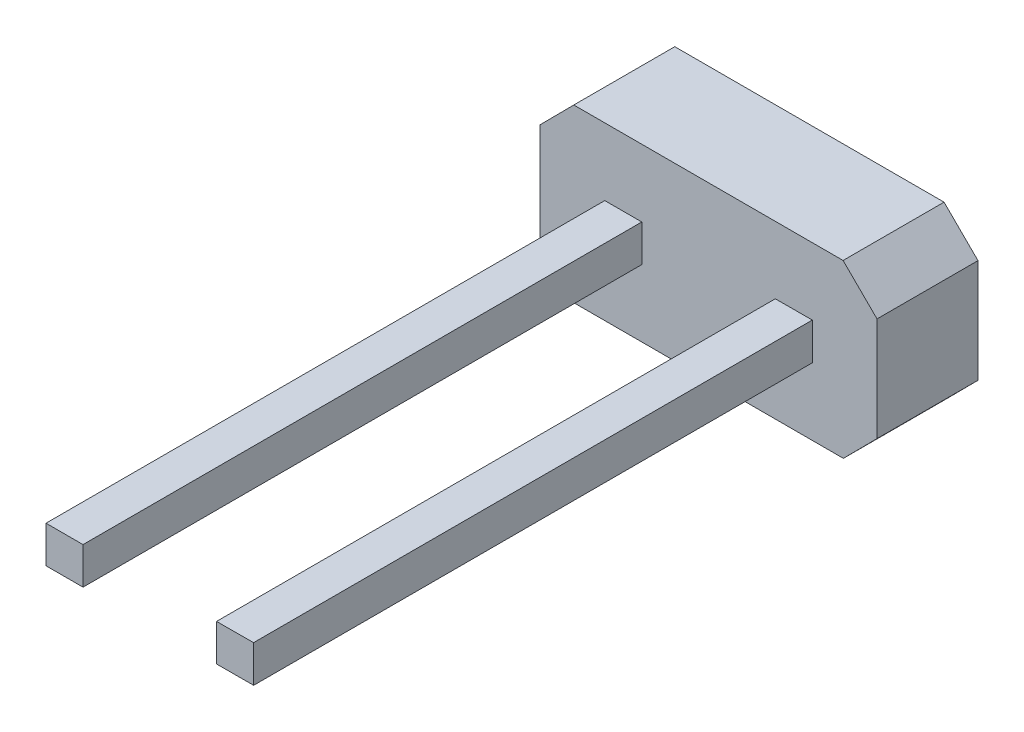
from build123d import *

# Parameters (mm, degrees)
BOSS_EXTRUDE1_DEPTH = 1.5
SKETCH2_W           = 0.55
SKETCH2_H           = 0.548166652
BOSS_EXTRUDE2_DEPTH = 8.3


with BuildPart() as part:
    # Sketch1 → Boss-Extrude1 (new body)
    with BuildSketch(Plane.XY):
        Polygon((-1.929641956, 0), (2.070358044, 0), (2.570358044, 0.504083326), (2.570358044, 2.044083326), (2.066274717, 2.544083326), (-1.933725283, 2.544083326), (-2.433725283, 2.04), (-2.433725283, 0.5), align=None)
    extrude(amount=BOSS_EXTRUDE1_DEPTH)

    # Sketch2 → Boss-Extrude2 (add)
    with BuildSketch(Plane.XY.offset(1.5)):
        with Locations((-1.198725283, 1.27)):
            Rectangle(SKETCH2_W, SKETCH2_H)
        Polygon((1.611236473, 1.000868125), (1.061239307, 0.999102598), (1.059479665, 1.547266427), (1.609476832, 1.549031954), align=None)
    extrude(amount=BOSS_EXTRUDE2_DEPTH)


solid = part.part
